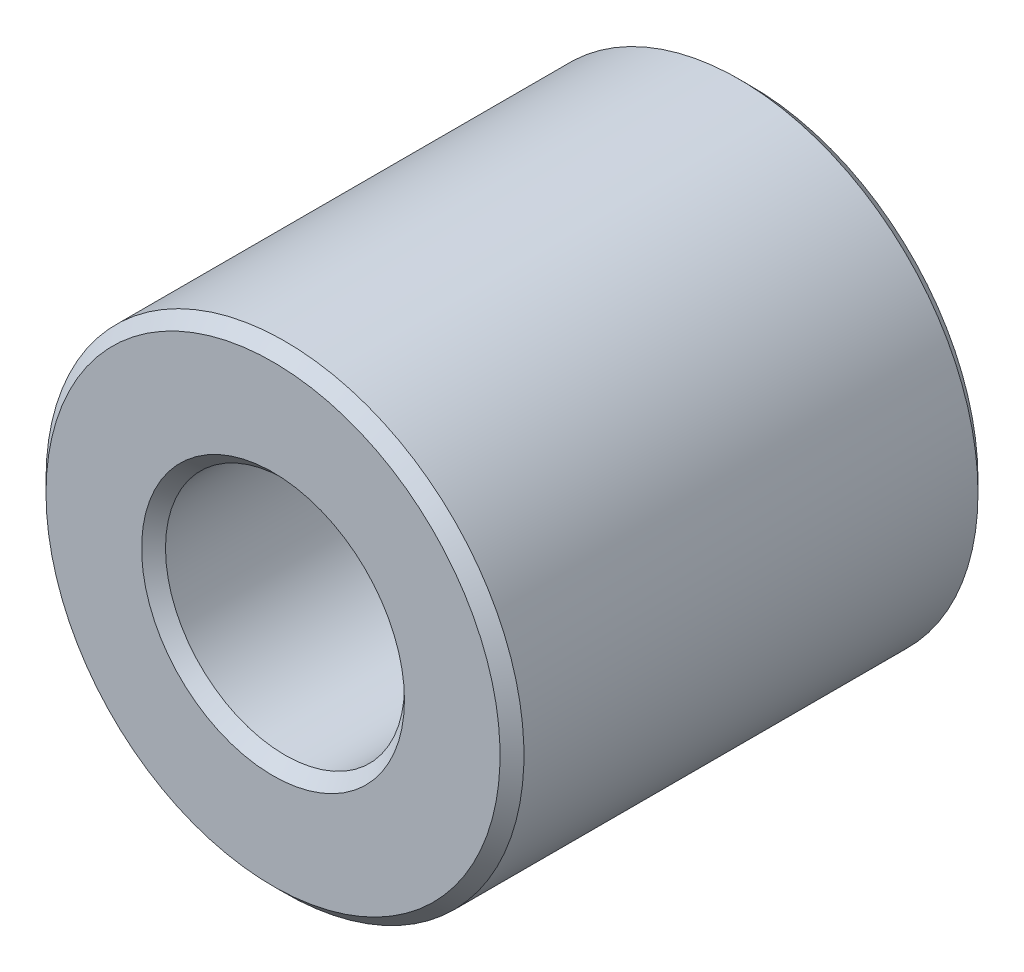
ISO-10303-21;
HEADER;
FILE_DESCRIPTION(('STEP AP214'),'2;1');
FILE_NAME('part.step','',(''),(''),'','','');
FILE_SCHEMA(('AUTOMOTIVE_DESIGN { 1 0 10303 214 1 1 1 1 }'));
ENDSEC;
DATA;
#1=APPLICATION_CONTEXT('core data for automotive mechanical design processes');
#2=APPLICATION_PROTOCOL_DEFINITION('international standard','automotive_design',2000,#1);
#3=PRODUCT_CONTEXT('',#1,'mechanical');
#4=PRODUCT('Part','Part','',(#3));
#5=PRODUCT_RELATED_PRODUCT_CATEGORY('part','',(#4));
#6=PRODUCT_DEFINITION_FORMATION('','',#4);
#7=PRODUCT_DEFINITION_CONTEXT('part definition',#1,'design');
#8=PRODUCT_DEFINITION('design','',#6,#7);
#9=PRODUCT_DEFINITION_SHAPE('','',#8);
#10=(LENGTH_UNIT() NAMED_UNIT(*) SI_UNIT(.MILLI.,.METRE.));
#11=(NAMED_UNIT(*) PLANE_ANGLE_UNIT() SI_UNIT($,.RADIAN.));
#12=(NAMED_UNIT(*) SI_UNIT($,.STERADIAN.) SOLID_ANGLE_UNIT());
#13=UNCERTAINTY_MEASURE_WITH_UNIT(LENGTH_MEASURE(1.E-05),#10,'distance_accuracy_value','');
#14=(GEOMETRIC_REPRESENTATION_CONTEXT(3) GLOBAL_UNCERTAINTY_ASSIGNED_CONTEXT((#13)) GLOBAL_UNIT_ASSIGNED_CONTEXT((#10,
#11,#12)) REPRESENTATION_CONTEXT('',''));
#15=CARTESIAN_POINT('',(0.,0.,0.));
#16=DIRECTION('',(0.,0.,1.));
#17=DIRECTION('',(1.,0.,0.));
#18=AXIS2_PLACEMENT_3D('',#15,#16,#17);
#19=CARTESIAN_POINT('',(0.,0.,30.));
#20=DIRECTION('',(0.,0.,1.));
#21=DIRECTION('',(1.,0.,0.));
#22=AXIS2_PLACEMENT_3D('',#19,#20,#21);
#23=PLANE('',#22);
#24=CARTESIAN_POINT('',(0.,0.,30.));
#25=DIRECTION('',(0.,0.,1.));
#26=DIRECTION('',(1.,0.,0.));
#27=AXIS2_PLACEMENT_3D('',#24,#25,#26);
#28=CIRCLE('',#27,16.5);
#29=CARTESIAN_POINT('',(16.5,0.,30.));
#30=VERTEX_POINT('',#29);
#31=EDGE_CURVE('E10',#30,#30,#28,.F.);
#32=ORIENTED_EDGE('',*,*,#31,.T.);
#33=EDGE_LOOP('',(#32));
#34=FACE_BOUND('',#33,.T.);
#35=CARTESIAN_POINT('',(0.,0.,30.));
#36=DIRECTION('',(0.,0.,1.));
#37=DIRECTION('',(1.,0.,0.));
#38=AXIS2_PLACEMENT_3D('',#35,#36,#37);
#39=CIRCLE('',#38,28.5);
#40=CARTESIAN_POINT('',(-28.5,0.,30.));
#41=VERTEX_POINT('',#40);
#42=EDGE_CURVE('E45',#41,#41,#39,.T.);
#43=ORIENTED_EDGE('',*,*,#42,.T.);
#44=EDGE_LOOP('',(#43));
#45=FACE_BOUND('',#44,.T.);
#46=ADVANCED_FACE('F37',(#34,#45),#23,.T.);
#47=CARTESIAN_POINT('',(0.,0.,-30.));
#48=DIRECTION('',(0.,0.,1.));
#49=DIRECTION('',(1.,0.,0.));
#50=AXIS2_PLACEMENT_3D('',#47,#48,#49);
#51=PLANE('',#50);
#52=CARTESIAN_POINT('',(0.,0.,-30.));
#53=DIRECTION('',(0.,0.,1.));
#54=DIRECTION('',(1.,0.,0.));
#55=AXIS2_PLACEMENT_3D('',#52,#53,#54);
#56=CIRCLE('',#55,16.5);
#57=CARTESIAN_POINT('',(16.5,0.,-30.));
#58=VERTEX_POINT('',#57);
#59=EDGE_CURVE('E71',#58,#58,#56,.T.);
#60=ORIENTED_EDGE('',*,*,#59,.T.);
#61=EDGE_LOOP('',(#60));
#62=FACE_BOUND('',#61,.T.);
#63=CARTESIAN_POINT('',(0.,0.,-30.));
#64=DIRECTION('',(0.,0.,1.));
#65=DIRECTION('',(1.,0.,0.));
#66=AXIS2_PLACEMENT_3D('',#63,#64,#65);
#67=CIRCLE('',#66,28.5);
#68=CARTESIAN_POINT('',(28.5,0.,-30.));
#69=VERTEX_POINT('',#68);
#70=EDGE_CURVE('E74',#69,#69,#67,.F.);
#71=ORIENTED_EDGE('',*,*,#70,.T.);
#72=EDGE_LOOP('',(#71));
#73=FACE_BOUND('',#72,.T.);
#74=ADVANCED_FACE('F78',(#62,#73),#51,.F.);
#75=CARTESIAN_POINT('',(0.,0.,30.));
#76=DIRECTION('',(0.,0.,-1.));
#77=DIRECTION('',(-1.,0.,0.));
#78=AXIS2_PLACEMENT_3D('',#75,#76,#77);
#79=CYLINDRICAL_SURFACE('',#78,30.);
#80=CARTESIAN_POINT('',(0.,0.,-28.5));
#81=DIRECTION('',(0.,0.,1.));
#82=DIRECTION('',(1.,0.,0.));
#83=AXIS2_PLACEMENT_3D('',#80,#81,#82);
#84=CIRCLE('',#83,30.);
#85=CARTESIAN_POINT('',(30.,0.,-28.5));
#86=VERTEX_POINT('',#85);
#87=EDGE_CURVE('E51',#86,#86,#84,.T.);
#88=ORIENTED_EDGE('',*,*,#87,.T.);
#89=EDGE_LOOP('',(#88));
#90=FACE_BOUND('',#89,.T.);
#91=CARTESIAN_POINT('',(0.,0.,28.5));
#92=DIRECTION('',(0.,0.,1.));
#93=DIRECTION('',(1.,0.,0.));
#94=AXIS2_PLACEMENT_3D('',#91,#92,#93);
#95=CIRCLE('',#94,30.);
#96=CARTESIAN_POINT('',(-30.,0.,28.5));
#97=VERTEX_POINT('',#96);
#98=EDGE_CURVE('E57',#97,#97,#95,.F.);
#99=ORIENTED_EDGE('',*,*,#98,.T.);
#100=EDGE_LOOP('',(#99));
#101=FACE_BOUND('',#100,.T.);
#102=ADVANCED_FACE('F88',(#90,#101),#79,.T.);
#103=CARTESIAN_POINT('',(0.,0.,30.));
#104=DIRECTION('',(0.,0.,-1.));
#105=DIRECTION('',(-1.,0.,0.));
#106=AXIS2_PLACEMENT_3D('',#103,#104,#105);
#107=CYLINDRICAL_SURFACE('',#106,15.);
#108=CARTESIAN_POINT('',(0.,0.,-28.5));
#109=DIRECTION('',(0.,0.,1.));
#110=DIRECTION('',(1.,0.,0.));
#111=AXIS2_PLACEMENT_3D('',#108,#109,#110);
#112=CIRCLE('',#111,15.);
#113=CARTESIAN_POINT('',(15.,0.,-28.5));
#114=VERTEX_POINT('',#113);
#115=EDGE_CURVE('E63',#114,#114,#112,.F.);
#116=ORIENTED_EDGE('',*,*,#115,.T.);
#117=EDGE_LOOP('',(#116));
#118=FACE_BOUND('',#117,.T.);
#119=CARTESIAN_POINT('',(0.,0.,28.5));
#120=DIRECTION('',(0.,0.,1.));
#121=DIRECTION('',(1.,0.,0.));
#122=AXIS2_PLACEMENT_3D('',#119,#120,#121);
#123=CIRCLE('',#122,15.);
#124=CARTESIAN_POINT('',(15.,0.,28.5));
#125=VERTEX_POINT('',#124);
#126=EDGE_CURVE('E67',#125,#125,#123,.T.);
#127=ORIENTED_EDGE('',*,*,#126,.T.);
#128=EDGE_LOOP('',(#127));
#129=FACE_BOUND('',#128,.T.);
#130=ADVANCED_FACE('F91',(#118,#129),#107,.F.);
#131=CARTESIAN_POINT('',(0.,0.,-30.));
#132=DIRECTION('',(0.,0.,-1.));
#133=DIRECTION('',(-1.,0.,0.));
#134=AXIS2_PLACEMENT_3D('',#131,#132,#133);
#135=CONICAL_SURFACE('',#134,16.5,0.785398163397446);
#136=ORIENTED_EDGE('',*,*,#115,.F.);
#137=EDGE_LOOP('',(#136));
#138=FACE_BOUND('',#137,.T.);
#139=ORIENTED_EDGE('',*,*,#59,.F.);
#140=EDGE_LOOP('',(#139));
#141=FACE_BOUND('',#140,.T.);
#142=ADVANCED_FACE('F84',(#138,#141),#135,.F.);
#143=CARTESIAN_POINT('',(0.,0.,-28.5));
#144=DIRECTION('',(0.,0.,1.));
#145=DIRECTION('',(1.,0.,0.));
#146=AXIS2_PLACEMENT_3D('',#143,#144,#145);
#147=CONICAL_SURFACE('',#146,30.,0.785398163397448);
#148=ORIENTED_EDGE('',*,*,#70,.F.);
#149=EDGE_LOOP('',(#148));
#150=FACE_BOUND('',#149,.T.);
#151=ORIENTED_EDGE('',*,*,#87,.F.);
#152=EDGE_LOOP('',(#151));
#153=FACE_BOUND('',#152,.T.);
#154=ADVANCED_FACE('F80',(#150,#153),#147,.T.);
#155=CARTESIAN_POINT('',(0.,0.,28.5));
#156=DIRECTION('',(0.,0.,1.));
#157=DIRECTION('',(1.,0.,0.));
#158=AXIS2_PLACEMENT_3D('',#155,#156,#157);
#159=CONICAL_SURFACE('',#158,15.,0.785398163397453);
#160=ORIENTED_EDGE('',*,*,#31,.F.);
#161=EDGE_LOOP('',(#160));
#162=FACE_BOUND('',#161,.T.);
#163=ORIENTED_EDGE('',*,*,#126,.F.);
#164=EDGE_LOOP('',(#163));
#165=FACE_BOUND('',#164,.T.);
#166=ADVANCED_FACE('F83',(#162,#165),#159,.F.);
#167=CARTESIAN_POINT('',(0.,0.,30.));
#168=DIRECTION('',(0.,0.,-1.));
#169=DIRECTION('',(-1.,0.,0.));
#170=AXIS2_PLACEMENT_3D('',#167,#168,#169);
#171=CONICAL_SURFACE('',#170,28.5,0.785398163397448);
#172=CARTESIAN_POINT('',(-30.,0.,28.5));
#173=CARTESIAN_POINT('',(-29.984375,0.,28.515625));
#174=CARTESIAN_POINT('',(-29.96875,0.,28.53125));
#175=CARTESIAN_POINT('',(-29.9375,0.,28.5625));
#176=CARTESIAN_POINT('',(-29.921875,0.,28.578125));
#177=CARTESIAN_POINT('',(-29.890625,0.,28.609375));
#178=CARTESIAN_POINT('',(-29.875,0.,28.625));
#179=CARTESIAN_POINT('',(-29.84375,0.,28.65625));
#180=CARTESIAN_POINT('',(-29.828125,0.,28.671875));
#181=CARTESIAN_POINT('',(-29.796875,0.,28.703125));
#182=CARTESIAN_POINT('',(-29.78125,0.,28.71875));
#183=CARTESIAN_POINT('',(-29.75,0.,28.75));
#184=CARTESIAN_POINT('',(-29.734375,0.,28.765625));
#185=CARTESIAN_POINT('',(-29.703125,0.,28.796875));
#186=CARTESIAN_POINT('',(-29.6875,0.,28.8125));
#187=CARTESIAN_POINT('',(-29.65625,0.,28.84375));
#188=CARTESIAN_POINT('',(-29.640625,0.,28.859375));
#189=CARTESIAN_POINT('',(-29.609375,0.,28.890625));
#190=CARTESIAN_POINT('',(-29.59375,0.,28.90625));
#191=CARTESIAN_POINT('',(-29.5625,0.,28.9375));
#192=CARTESIAN_POINT('',(-29.546875,0.,28.953125));
#193=CARTESIAN_POINT('',(-29.515625,0.,28.984375));
#194=CARTESIAN_POINT('',(-29.5,0.,29.));
#195=CARTESIAN_POINT('',(-29.46875,0.,29.03125));
#196=CARTESIAN_POINT('',(-29.453125,0.,29.046875));
#197=CARTESIAN_POINT('',(-29.421875,0.,29.078125));
#198=CARTESIAN_POINT('',(-29.40625,0.,29.09375));
#199=CARTESIAN_POINT('',(-29.375,0.,29.125));
#200=CARTESIAN_POINT('',(-29.359375,0.,29.140625));
#201=CARTESIAN_POINT('',(-29.328125,0.,29.171875));
#202=CARTESIAN_POINT('',(-29.3125,0.,29.1875));
#203=CARTESIAN_POINT('',(-29.28125,0.,29.21875));
#204=CARTESIAN_POINT('',(-29.265625,0.,29.234375));
#205=CARTESIAN_POINT('',(-29.234375,0.,29.265625));
#206=CARTESIAN_POINT('',(-29.21875,0.,29.28125));
#207=CARTESIAN_POINT('',(-29.1875,0.,29.3125));
#208=CARTESIAN_POINT('',(-29.171875,0.,29.328125));
#209=CARTESIAN_POINT('',(-29.140625,0.,29.359375));
#210=CARTESIAN_POINT('',(-29.125,0.,29.375));
#211=CARTESIAN_POINT('',(-29.09375,0.,29.40625));
#212=CARTESIAN_POINT('',(-29.078125,0.,29.421875));
#213=CARTESIAN_POINT('',(-29.046875,0.,29.453125));
#214=CARTESIAN_POINT('',(-29.03125,0.,29.46875));
#215=CARTESIAN_POINT('',(-29.,0.,29.5));
#216=CARTESIAN_POINT('',(-28.984375,0.,29.515625));
#217=CARTESIAN_POINT('',(-28.953125,0.,29.546875));
#218=CARTESIAN_POINT('',(-28.9375,0.,29.5625));
#219=CARTESIAN_POINT('',(-28.90625,0.,29.59375));
#220=CARTESIAN_POINT('',(-28.890625,0.,29.609375));
#221=CARTESIAN_POINT('',(-28.859375,0.,29.640625));
#222=CARTESIAN_POINT('',(-28.84375,0.,29.65625));
#223=CARTESIAN_POINT('',(-28.8125,0.,29.6875));
#224=CARTESIAN_POINT('',(-28.796875,0.,29.703125));
#225=CARTESIAN_POINT('',(-28.765625,0.,29.734375));
#226=CARTESIAN_POINT('',(-28.75,0.,29.75));
#227=CARTESIAN_POINT('',(-28.71875,0.,29.78125));
#228=CARTESIAN_POINT('',(-28.703125,0.,29.796875));
#229=CARTESIAN_POINT('',(-28.671875,0.,29.828125));
#230=CARTESIAN_POINT('',(-28.65625,0.,29.84375));
#231=CARTESIAN_POINT('',(-28.625,0.,29.875));
#232=CARTESIAN_POINT('',(-28.609375,0.,29.890625));
#233=CARTESIAN_POINT('',(-28.578125,0.,29.921875));
#234=CARTESIAN_POINT('',(-28.5625,0.,29.9375));
#235=CARTESIAN_POINT('',(-28.53125,0.,29.96875));
#236=CARTESIAN_POINT('',(-28.515625,0.,29.984375));
#237=CARTESIAN_POINT('',(-28.5,0.,30.));
#238=B_SPLINE_CURVE_WITH_KNOTS('',3,(#172,#173,#174,#175,#176,#177,#178,#179,#180,#181,#182,
#183,#184,#185,#186,#187,#188,#189,#190,#191,#192,#193,#194,#195,#196,#197,#198,#199,#200,#201,
#202,#203,#204,#205,#206,#207,#208,#209,#210,#211,#212,#213,#214,#215,#216,#217,#218,#219,#220,
#221,#222,#223,#224,#225,#226,#227,#228,#229,#230,#231,#232,#233,#234,#235,#236,#237),
.UNSPECIFIED.,.F.,.F.,(4,2,2,2,2,2,2,2,2,2,2,2,2,2,2,2,2,2,2,2,2,2,2,2,2,2,2,2,2,2,2,2,4),(0.,
0.0662912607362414,0.132582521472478,0.198873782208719,0.265165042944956,0.331456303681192,
0.397747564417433,0.46403882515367,0.530330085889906,0.596621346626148,0.662912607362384,
0.729203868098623,0.795495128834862,0.861786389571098,0.92807765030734,0.994368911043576,
1.06066017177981,1.12695143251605,1.19324269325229,1.25953395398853,1.32582521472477,
1.392116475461,1.45840773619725,1.52469899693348,1.59099025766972,1.65728151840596,
1.7235727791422,1.78986403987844,1.85615530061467,1.92244656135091,1.98873782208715,
2.05502908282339,2.12132034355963),.UNSPECIFIED.);
#239=EDGE_CURVE('BSEAM39',#97,#41,#238,.T.);
#240=ORIENTED_EDGE('',*,*,#98,.F.);
#241=ORIENTED_EDGE('',*,*,#42,.F.);
#242=ORIENTED_EDGE('',*,*,#239,.T.);
#243=ORIENTED_EDGE('',*,*,#239,.F.);
#244=EDGE_LOOP('',(#240,#242,#241,#243));
#245=FACE_BOUND('',#244,.T.);
#246=ADVANCED_FACE('F39',(#245),#171,.T.);
#247=CLOSED_SHELL('',(#46,#74,#102,#130,#142,#154,#166,#246));
#248=MANIFOLD_SOLID_BREP('B2',#247);
#249=ADVANCED_BREP_SHAPE_REPRESENTATION('',(#18,#248),#14);
#250=SHAPE_DEFINITION_REPRESENTATION(#9,#249);
ENDSEC;
END-ISO-10303-21;
